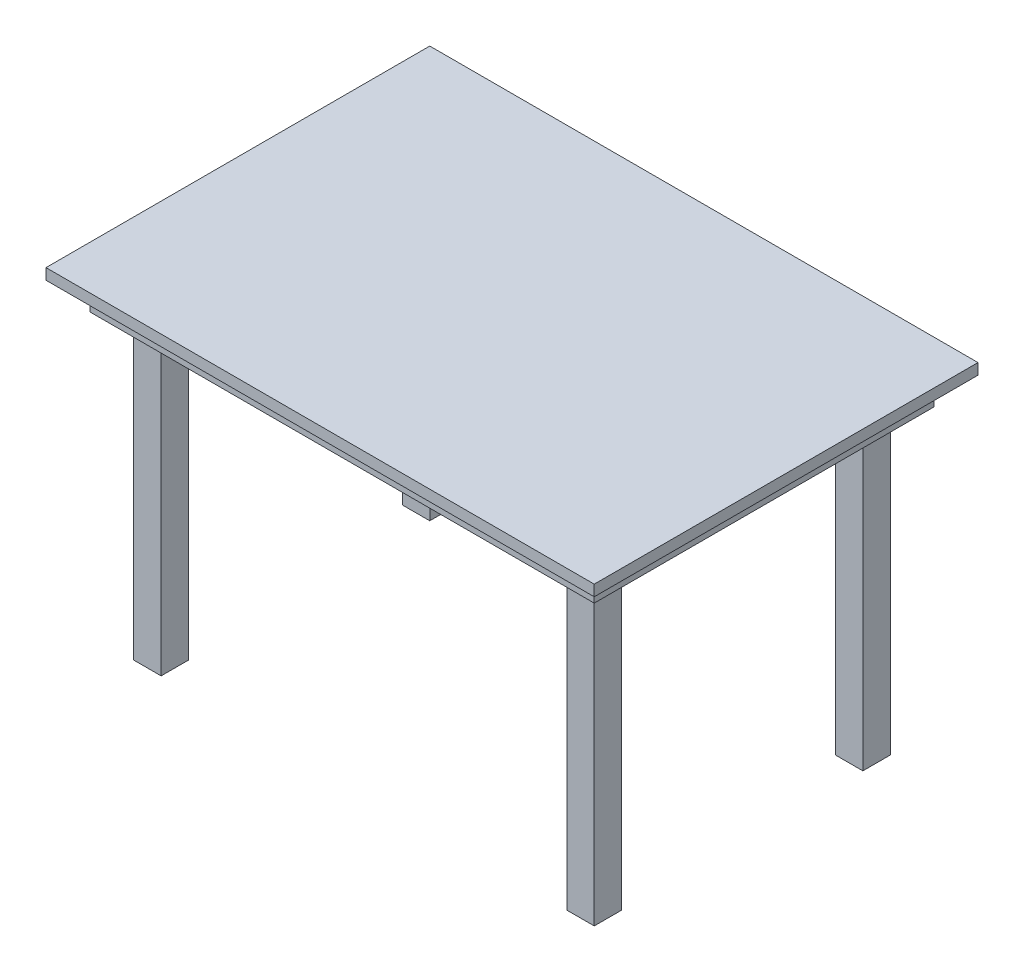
ISO-10303-21;
HEADER;
FILE_DESCRIPTION(('STEP AP214'),'2;1');
FILE_NAME('part.step','',(''),(''),'','','');
FILE_SCHEMA(('AUTOMOTIVE_DESIGN { 1 0 10303 214 1 1 1 1 }'));
ENDSEC;
DATA;
#1=APPLICATION_CONTEXT('core data for automotive mechanical design processes');
#2=APPLICATION_PROTOCOL_DEFINITION('international standard','automotive_design',2000,#1);
#3=PRODUCT_CONTEXT('',#1,'mechanical');
#4=PRODUCT('Part','Part','',(#3));
#5=PRODUCT_RELATED_PRODUCT_CATEGORY('part','',(#4));
#6=PRODUCT_DEFINITION_FORMATION('','',#4);
#7=PRODUCT_DEFINITION_CONTEXT('part definition',#1,'design');
#8=PRODUCT_DEFINITION('design','',#6,#7);
#9=PRODUCT_DEFINITION_SHAPE('','',#8);
#10=(LENGTH_UNIT() NAMED_UNIT(*) SI_UNIT(.MILLI.,.METRE.));
#11=(NAMED_UNIT(*) PLANE_ANGLE_UNIT() SI_UNIT($,.RADIAN.));
#12=(NAMED_UNIT(*) SI_UNIT($,.STERADIAN.) SOLID_ANGLE_UNIT());
#13=UNCERTAINTY_MEASURE_WITH_UNIT(LENGTH_MEASURE(1.E-05),#10,'distance_accuracy_value','');
#14=(GEOMETRIC_REPRESENTATION_CONTEXT(3) GLOBAL_UNCERTAINTY_ASSIGNED_CONTEXT((#13)) GLOBAL_UNIT_ASSIGNED_CONTEXT((#10,
#11,#12)) REPRESENTATION_CONTEXT('',''));
#15=CARTESIAN_POINT('',(0.,0.,0.));
#16=DIRECTION('',(0.,0.,1.));
#17=DIRECTION('',(1.,0.,0.));
#18=AXIS2_PLACEMENT_3D('',#15,#16,#17);
#19=CARTESIAN_POINT('',(0.,0.,0.));
#20=DIRECTION('',(0.,-1.,0.));
#21=DIRECTION('',(0.,0.,-1.));
#22=AXIS2_PLACEMENT_3D('',#19,#20,#21);
#23=PLANE('',#22);
#24=DIRECTION('',(-1.,0.,0.));
#25=VECTOR('',#24,1.);
#26=CARTESIAN_POINT('',(80.0000000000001,0.,-570.));
#27=LINE('',#26,#25);
#28=CARTESIAN_POINT('',(130.,0.,-570.));
#29=VERTEX_POINT('',#28);
#30=CARTESIAN_POINT('',(80.,0.,-570.));
#31=VERTEX_POINT('',#30);
#32=EDGE_CURVE('E51',#29,#31,#27,.T.);
#33=ORIENTED_EDGE('',*,*,#32,.F.);
#34=DIRECTION('',(0.,0.,1.));
#35=VECTOR('',#34,1.);
#36=CARTESIAN_POINT('',(130.,0.,-620.));
#37=LINE('',#36,#35);
#38=CARTESIAN_POINT('',(130.,0.,-620.));
#39=VERTEX_POINT('',#38);
#40=EDGE_CURVE('E55',#39,#29,#37,.T.);
#41=ORIENTED_EDGE('',*,*,#40,.F.);
#42=DIRECTION('',(1.,0.,0.));
#43=VECTOR('',#42,1.);
#44=CARTESIAN_POINT('',(80.,0.,-620.));
#45=LINE('',#44,#43);
#46=CARTESIAN_POINT('',(870.,0.,-620.));
#47=VERTEX_POINT('',#46);
#48=EDGE_CURVE('E355',#39,#47,#45,.T.);
#49=ORIENTED_EDGE('',*,*,#48,.T.);
#50=DIRECTION('',(0.,0.,-1.));
#51=VECTOR('',#50,1.);
#52=CARTESIAN_POINT('',(870.,0.,-620.));
#53=LINE('',#52,#51);
#54=CARTESIAN_POINT('',(870.,0.,-570.));
#55=VERTEX_POINT('',#54);
#56=EDGE_CURVE('E246',#55,#47,#53,.T.);
#57=ORIENTED_EDGE('',*,*,#56,.F.);
#58=DIRECTION('',(-1.,0.,0.));
#59=VECTOR('',#58,1.);
#60=CARTESIAN_POINT('',(920.,0.,-570.));
#61=LINE('',#60,#59);
#62=CARTESIAN_POINT('',(920.,0.,-570.));
#63=VERTEX_POINT('',#62);
#64=EDGE_CURVE('E244',#63,#55,#61,.T.);
#65=ORIENTED_EDGE('',*,*,#64,.F.);
#66=DIRECTION('',(0.,0.,1.));
#67=VECTOR('',#66,1.);
#68=CARTESIAN_POINT('',(920.,0.,-620.));
#69=LINE('',#68,#67);
#70=CARTESIAN_POINT('',(920.,0.,-130.));
#71=VERTEX_POINT('',#70);
#72=EDGE_CURVE('E334',#63,#71,#69,.T.);
#73=ORIENTED_EDGE('',*,*,#72,.T.);
#74=DIRECTION('',(1.,0.,0.));
#75=VECTOR('',#74,1.);
#76=CARTESIAN_POINT('',(920.,0.,-130.));
#77=LINE('',#76,#75);
#78=CARTESIAN_POINT('',(870.,0.,-130.));
#79=VERTEX_POINT('',#78);
#80=EDGE_CURVE('E281',#79,#71,#77,.T.);
#81=ORIENTED_EDGE('',*,*,#80,.F.);
#82=DIRECTION('',(0.,0.,-1.));
#83=VECTOR('',#82,1.);
#84=CARTESIAN_POINT('',(870.,0.,-79.9999999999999));
#85=LINE('',#84,#83);
#86=CARTESIAN_POINT('',(870.,0.,-79.9999999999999));
#87=VERTEX_POINT('',#86);
#88=EDGE_CURVE('E276',#87,#79,#85,.T.);
#89=ORIENTED_EDGE('',*,*,#88,.F.);
#90=DIRECTION('',(-1.,0.,0.));
#91=VECTOR('',#90,1.);
#92=CARTESIAN_POINT('',(920.,0.,-80.));
#93=LINE('',#92,#91);
#94=CARTESIAN_POINT('',(130.,0.,-80.));
#95=VERTEX_POINT('',#94);
#96=EDGE_CURVE('E351',#87,#95,#93,.T.);
#97=ORIENTED_EDGE('',*,*,#96,.T.);
#98=DIRECTION('',(0.,0.,1.));
#99=VECTOR('',#98,1.);
#100=CARTESIAN_POINT('',(130.,0.,-80.));
#101=LINE('',#100,#99);
#102=CARTESIAN_POINT('',(130.,0.,-130.));
#103=VERTEX_POINT('',#102);
#104=EDGE_CURVE('E308',#103,#95,#101,.T.);
#105=ORIENTED_EDGE('',*,*,#104,.F.);
#106=DIRECTION('',(1.,0.,0.));
#107=VECTOR('',#106,1.);
#108=CARTESIAN_POINT('',(80.,0.,-130.));
#109=LINE('',#108,#107);
#110=CARTESIAN_POINT('',(80.,0.,-130.));
#111=VERTEX_POINT('',#110);
#112=EDGE_CURVE('E303',#111,#103,#109,.T.);
#113=ORIENTED_EDGE('',*,*,#112,.F.);
#114=DIRECTION('',(0.,0.,-1.));
#115=VECTOR('',#114,1.);
#116=CARTESIAN_POINT('',(80.,0.,-80.));
#117=LINE('',#116,#115);
#118=EDGE_CURVE('E353',#111,#31,#117,.T.);
#119=ORIENTED_EDGE('',*,*,#118,.T.);
#120=EDGE_LOOP('',(#33,#41,#49,#57,#65,#73,#81,#89,#97,#105,#113,#119));
#121=FACE_BOUND('',#120,.T.);
#122=ADVANCED_FACE('F36',(#121),#23,.T.);
#123=CARTESIAN_POINT('',(80.,-50.,-620.));
#124=DIRECTION('',(0.,0.,1.));
#125=DIRECTION('',(1.,0.,0.));
#126=AXIS2_PLACEMENT_3D('',#123,#124,#125);
#127=PLANE('',#126);
#128=ORIENTED_EDGE('',*,*,#48,.F.);
#129=DIRECTION('',(0.,1.,0.));
#130=VECTOR('',#129,1.);
#131=CARTESIAN_POINT('',(130.,-600.,-620.));
#132=LINE('',#131,#130);
#133=CARTESIAN_POINT('',(130.,-50.,-620.));
#134=VERTEX_POINT('',#133);
#135=EDGE_CURVE('E248',#134,#39,#132,.T.);
#136=ORIENTED_EDGE('',*,*,#135,.F.);
#137=DIRECTION('',(1.,0.,0.));
#138=VECTOR('',#137,1.);
#139=CARTESIAN_POINT('',(80.,-50.,-620.));
#140=LINE('',#139,#138);
#141=CARTESIAN_POINT('',(870.,-50.,-620.));
#142=VERTEX_POINT('',#141);
#143=EDGE_CURVE('E349',#134,#142,#140,.T.);
#144=ORIENTED_EDGE('',*,*,#143,.T.);
#145=DIRECTION('',(0.,1.,0.));
#146=VECTOR('',#145,1.);
#147=CARTESIAN_POINT('',(870.,-50.,-620.));
#148=LINE('',#147,#146);
#149=EDGE_CURVE('E11',#142,#47,#148,.T.);
#150=ORIENTED_EDGE('',*,*,#149,.T.);
#151=EDGE_LOOP('',(#128,#136,#144,#150));
#152=FACE_BOUND('',#151,.T.);
#153=ADVANCED_FACE('F481',(#152),#127,.T.);
#154=CARTESIAN_POINT('',(80.,-50.,-80.));
#155=DIRECTION('',(1.,0.,0.));
#156=DIRECTION('',(0.,0.,-1.));
#157=AXIS2_PLACEMENT_3D('',#154,#155,#156);
#158=PLANE('',#157);
#159=DIRECTION('',(0.,0.,-1.));
#160=VECTOR('',#159,1.);
#161=CARTESIAN_POINT('',(80.,-50.,-80.));
#162=LINE('',#161,#160);
#163=CARTESIAN_POINT('',(80.,-50.,-130.));
#164=VERTEX_POINT('',#163);
#165=CARTESIAN_POINT('',(80.,-50.,-570.));
#166=VERTEX_POINT('',#165);
#167=EDGE_CURVE('E345',#164,#166,#162,.T.);
#168=ORIENTED_EDGE('',*,*,#167,.T.);
#169=DIRECTION('',(0.,1.,0.));
#170=VECTOR('',#169,1.);
#171=CARTESIAN_POINT('',(80.0000000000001,-600.,-570.));
#172=LINE('',#171,#170);
#173=EDGE_CURVE('E466',#166,#31,#172,.T.);
#174=ORIENTED_EDGE('',*,*,#173,.T.);
#175=ORIENTED_EDGE('',*,*,#118,.F.);
#176=DIRECTION('',(0.,1.,0.));
#177=VECTOR('',#176,1.);
#178=CARTESIAN_POINT('',(80.,-600.,-130.));
#179=LINE('',#178,#177);
#180=EDGE_CURVE('E327',#164,#111,#179,.T.);
#181=ORIENTED_EDGE('',*,*,#180,.F.);
#182=EDGE_LOOP('',(#168,#174,#175,#181));
#183=FACE_BOUND('',#182,.T.);
#184=ADVANCED_FACE('F463',(#183),#158,.T.);
#185=CARTESIAN_POINT('',(920.,-50.,-620.));
#186=DIRECTION('',(-1.,0.,0.));
#187=DIRECTION('',(0.,0.,1.));
#188=AXIS2_PLACEMENT_3D('',#185,#186,#187);
#189=PLANE('',#188);
#190=ORIENTED_EDGE('',*,*,#72,.F.);
#191=DIRECTION('',(0.,1.,0.));
#192=VECTOR('',#191,1.);
#193=CARTESIAN_POINT('',(920.,-600.,-570.));
#194=LINE('',#193,#192);
#195=CARTESIAN_POINT('',(920.,-50.,-570.));
#196=VERTEX_POINT('',#195);
#197=EDGE_CURVE('E272',#196,#63,#194,.T.);
#198=ORIENTED_EDGE('',*,*,#197,.F.);
#199=DIRECTION('',(0.,0.,1.));
#200=VECTOR('',#199,1.);
#201=CARTESIAN_POINT('',(920.,-50.,-620.));
#202=LINE('',#201,#200);
#203=CARTESIAN_POINT('',(920.,-50.,-130.));
#204=VERTEX_POINT('',#203);
#205=EDGE_CURVE('E338',#196,#204,#202,.T.);
#206=ORIENTED_EDGE('',*,*,#205,.T.);
#207=DIRECTION('',(0.,1.,0.));
#208=VECTOR('',#207,1.);
#209=CARTESIAN_POINT('',(920.,-50.,-130.));
#210=LINE('',#209,#208);
#211=EDGE_CURVE('E44',#204,#71,#210,.T.);
#212=ORIENTED_EDGE('',*,*,#211,.T.);
#213=EDGE_LOOP('',(#190,#198,#206,#212));
#214=FACE_BOUND('',#213,.T.);
#215=ADVANCED_FACE('F418',(#214),#189,.T.);
#216=CARTESIAN_POINT('',(920.,-50.,-80.));
#217=DIRECTION('',(0.,0.,-1.));
#218=DIRECTION('',(-1.,0.,0.));
#219=AXIS2_PLACEMENT_3D('',#216,#217,#218);
#220=PLANE('',#219);
#221=ORIENTED_EDGE('',*,*,#96,.F.);
#222=DIRECTION('',(0.,1.,0.));
#223=VECTOR('',#222,1.);
#224=CARTESIAN_POINT('',(870.,-600.,-79.9999999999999));
#225=LINE('',#224,#223);
#226=CARTESIAN_POINT('',(870.,-50.,-79.9999999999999));
#227=VERTEX_POINT('',#226);
#228=EDGE_CURVE('E296',#227,#87,#225,.T.);
#229=ORIENTED_EDGE('',*,*,#228,.F.);
#230=DIRECTION('',(-1.,0.,0.));
#231=VECTOR('',#230,1.);
#232=CARTESIAN_POINT('',(920.,-50.,-80.));
#233=LINE('',#232,#231);
#234=CARTESIAN_POINT('',(130.,-50.,-80.));
#235=VERTEX_POINT('',#234);
#236=EDGE_CURVE('E337',#227,#235,#233,.T.);
#237=ORIENTED_EDGE('',*,*,#236,.T.);
#238=DIRECTION('',(0.,1.,0.));
#239=VECTOR('',#238,1.);
#240=CARTESIAN_POINT('',(130.,-600.,-80.));
#241=LINE('',#240,#239);
#242=EDGE_CURVE('E321',#235,#95,#241,.T.);
#243=ORIENTED_EDGE('',*,*,#242,.T.);
#244=EDGE_LOOP('',(#221,#229,#237,#243));
#245=FACE_BOUND('',#244,.T.);
#246=ADVANCED_FACE('F447',(#245),#220,.T.);
#247=DIRECTION('',(0.,0.,1.));
#248=VECTOR('',#247,1.);
#249=CARTESIAN_POINT('',(0.,0.,0.));
#250=LINE('',#249,#248);
#251=CARTESIAN_POINT('',(0.,0.,-700.));
#252=VERTEX_POINT('',#251);
#253=CARTESIAN_POINT('',(0.,0.,0.));
#254=VERTEX_POINT('',#253);
#255=EDGE_CURVE('E385',#252,#254,#250,.T.);
#256=ORIENTED_EDGE('',*,*,#255,.F.);
#257=DIRECTION('',(-1.,0.,0.));
#258=VECTOR('',#257,1.);
#259=CARTESIAN_POINT('',(0.,0.,-700.));
#260=LINE('',#259,#258);
#261=CARTESIAN_POINT('',(1000.,0.,-700.));
#262=VERTEX_POINT('',#261);
#263=EDGE_CURVE('E390',#262,#252,#260,.T.);
#264=ORIENTED_EDGE('',*,*,#263,.F.);
#265=DIRECTION('',(0.,0.,-1.));
#266=VECTOR('',#265,1.);
#267=CARTESIAN_POINT('',(1000.,0.,0.));
#268=LINE('',#267,#266);
#269=CARTESIAN_POINT('',(1000.,0.,0.));
#270=VERTEX_POINT('',#269);
#271=EDGE_CURVE('E401',#270,#262,#268,.T.);
#272=ORIENTED_EDGE('',*,*,#271,.F.);
#273=DIRECTION('',(1.,0.,0.));
#274=VECTOR('',#273,1.);
#275=CARTESIAN_POINT('',(0.,0.,0.));
#276=LINE('',#275,#274);
#277=EDGE_CURVE('E399',#254,#270,#276,.T.);
#278=ORIENTED_EDGE('',*,*,#277,.F.);
#279=EDGE_LOOP('',(#256,#264,#272,#278));
#280=FACE_BOUND('',#279,.T.);
#281=DIRECTION('',(0.,0.,1.));
#282=VECTOR('',#281,1.);
#283=CARTESIAN_POINT('',(960.,0.,-660.));
#284=LINE('',#283,#282);
#285=CARTESIAN_POINT('',(960.,0.,-660.));
#286=VERTEX_POINT('',#285);
#287=CARTESIAN_POINT('',(960.,0.,-40.));
#288=VERTEX_POINT('',#287);
#289=EDGE_CURVE('E370',#286,#288,#284,.T.);
#290=ORIENTED_EDGE('',*,*,#289,.F.);
#291=DIRECTION('',(1.,0.,0.));
#292=VECTOR('',#291,1.);
#293=CARTESIAN_POINT('',(40.,0.,-660.));
#294=LINE('',#293,#292);
#295=CARTESIAN_POINT('',(40.,0.,-660.));
#296=VERTEX_POINT('',#295);
#297=EDGE_CURVE('E348',#296,#286,#294,.T.);
#298=ORIENTED_EDGE('',*,*,#297,.F.);
#299=DIRECTION('',(0.,0.,-1.));
#300=VECTOR('',#299,1.);
#301=CARTESIAN_POINT('',(40.,0.,-40.));
#302=LINE('',#301,#300);
#303=CARTESIAN_POINT('',(40.,0.,-40.));
#304=VERTEX_POINT('',#303);
#305=EDGE_CURVE('E361',#304,#296,#302,.T.);
#306=ORIENTED_EDGE('',*,*,#305,.F.);
#307=DIRECTION('',(-1.,0.,0.));
#308=VECTOR('',#307,1.);
#309=CARTESIAN_POINT('',(960.,0.,-40.));
#310=LINE('',#309,#308);
#311=EDGE_CURVE('E372',#288,#304,#310,.T.);
#312=ORIENTED_EDGE('',*,*,#311,.F.);
#313=EDGE_LOOP('',(#290,#298,#306,#312));
#314=FACE_BOUND('',#313,.T.);
#315=ADVANCED_FACE('F514',(#280,#314),#23,.T.);
#316=CARTESIAN_POINT('',(0.,20.,0.));
#317=DIRECTION('',(1.,0.,0.));
#318=DIRECTION('',(0.,0.,-1.));
#319=AXIS2_PLACEMENT_3D('',#316,#317,#318);
#320=PLANE('',#319);
#321=ORIENTED_EDGE('',*,*,#255,.T.);
#322=DIRECTION('',(0.,-1.,0.));
#323=VECTOR('',#322,1.);
#324=CARTESIAN_POINT('',(0.,20.,0.));
#325=LINE('',#324,#323);
#326=CARTESIAN_POINT('',(0.,20.,0.));
#327=VERTEX_POINT('',#326);
#328=EDGE_CURVE('E412',#327,#254,#325,.T.);
#329=ORIENTED_EDGE('',*,*,#328,.F.);
#330=DIRECTION('',(0.,0.,1.));
#331=VECTOR('',#330,1.);
#332=CARTESIAN_POINT('',(0.,20.,0.));
#333=LINE('',#332,#331);
#334=CARTESIAN_POINT('',(0.,20.,-700.));
#335=VERTEX_POINT('',#334);
#336=EDGE_CURVE('E386',#335,#327,#333,.T.);
#337=ORIENTED_EDGE('',*,*,#336,.F.);
#338=DIRECTION('',(0.,-1.,0.));
#339=VECTOR('',#338,1.);
#340=CARTESIAN_POINT('',(0.,20.,-700.));
#341=LINE('',#340,#339);
#342=EDGE_CURVE('E396',#335,#252,#341,.T.);
#343=ORIENTED_EDGE('',*,*,#342,.T.);
#344=EDGE_LOOP('',(#321,#329,#337,#343));
#345=FACE_BOUND('',#344,.T.);
#346=ADVANCED_FACE('F38',(#345),#320,.F.);
#347=CARTESIAN_POINT('',(0.,20.,0.));
#348=DIRECTION('',(0.,0.,-1.));
#349=DIRECTION('',(-1.,0.,0.));
#350=AXIS2_PLACEMENT_3D('',#347,#348,#349);
#351=PLANE('',#350);
#352=ORIENTED_EDGE('',*,*,#277,.T.);
#353=DIRECTION('',(0.,-1.,0.));
#354=VECTOR('',#353,1.);
#355=CARTESIAN_POINT('',(1000.,20.,0.));
#356=LINE('',#355,#354);
#357=CARTESIAN_POINT('',(1000.,20.,0.));
#358=VERTEX_POINT('',#357);
#359=EDGE_CURVE('E409',#358,#270,#356,.T.);
#360=ORIENTED_EDGE('',*,*,#359,.F.);
#361=DIRECTION('',(1.,0.,0.));
#362=VECTOR('',#361,1.);
#363=CARTESIAN_POINT('',(0.,20.,0.));
#364=LINE('',#363,#362);
#365=EDGE_CURVE('E389',#327,#358,#364,.T.);
#366=ORIENTED_EDGE('',*,*,#365,.F.);
#367=ORIENTED_EDGE('',*,*,#328,.T.);
#368=EDGE_LOOP('',(#352,#360,#366,#367));
#369=FACE_BOUND('',#368,.T.);
#370=ADVANCED_FACE('F527',(#369),#351,.F.);
#371=CARTESIAN_POINT('',(1000.,20.,0.));
#372=DIRECTION('',(-1.,0.,0.));
#373=DIRECTION('',(0.,0.,1.));
#374=AXIS2_PLACEMENT_3D('',#371,#372,#373);
#375=PLANE('',#374);
#376=ORIENTED_EDGE('',*,*,#271,.T.);
#377=DIRECTION('',(0.,-1.,0.));
#378=VECTOR('',#377,1.);
#379=CARTESIAN_POINT('',(1000.,20.,-700.));
#380=LINE('',#379,#378);
#381=CARTESIAN_POINT('',(1000.,20.,-700.));
#382=VERTEX_POINT('',#381);
#383=EDGE_CURVE('E406',#382,#262,#380,.T.);
#384=ORIENTED_EDGE('',*,*,#383,.F.);
#385=DIRECTION('',(0.,0.,-1.));
#386=VECTOR('',#385,1.);
#387=CARTESIAN_POINT('',(1000.,20.,0.));
#388=LINE('',#387,#386);
#389=EDGE_CURVE('E392',#358,#382,#388,.T.);
#390=ORIENTED_EDGE('',*,*,#389,.F.);
#391=ORIENTED_EDGE('',*,*,#359,.T.);
#392=EDGE_LOOP('',(#376,#384,#390,#391));
#393=FACE_BOUND('',#392,.T.);
#394=ADVANCED_FACE('F577',(#393),#375,.F.);
#395=CARTESIAN_POINT('',(0.,20.,-700.));
#396=DIRECTION('',(0.,0.,1.));
#397=DIRECTION('',(1.,0.,0.));
#398=AXIS2_PLACEMENT_3D('',#395,#396,#397);
#399=PLANE('',#398);
#400=ORIENTED_EDGE('',*,*,#263,.T.);
#401=ORIENTED_EDGE('',*,*,#342,.F.);
#402=DIRECTION('',(-1.,0.,0.));
#403=VECTOR('',#402,1.);
#404=CARTESIAN_POINT('',(0.,20.,-700.));
#405=LINE('',#404,#403);
#406=EDGE_CURVE('E394',#382,#335,#405,.T.);
#407=ORIENTED_EDGE('',*,*,#406,.F.);
#408=ORIENTED_EDGE('',*,*,#383,.T.);
#409=EDGE_LOOP('',(#400,#401,#407,#408));
#410=FACE_BOUND('',#409,.T.);
#411=ADVANCED_FACE('F571',(#410),#399,.F.);
#412=CARTESIAN_POINT('',(0.,20.,0.));
#413=DIRECTION('',(0.,-1.,0.));
#414=DIRECTION('',(0.,0.,-1.));
#415=AXIS2_PLACEMENT_3D('',#412,#413,#414);
#416=PLANE('',#415);
#417=ORIENTED_EDGE('',*,*,#336,.T.);
#418=ORIENTED_EDGE('',*,*,#365,.T.);
#419=ORIENTED_EDGE('',*,*,#389,.T.);
#420=ORIENTED_EDGE('',*,*,#406,.T.);
#421=EDGE_LOOP('',(#417,#418,#419,#420));
#422=FACE_BOUND('',#421,.T.);
#423=ADVANCED_FACE('F569',(#422),#416,.F.);
#424=CARTESIAN_POINT('',(0.,-50.,0.));
#425=DIRECTION('',(0.,-1.,0.));
#426=DIRECTION('',(0.,0.,-1.));
#427=AXIS2_PLACEMENT_3D('',#424,#425,#426);
#428=PLANE('',#427);
#429=DIRECTION('',(1.,0.,0.));
#430=VECTOR('',#429,1.);
#431=CARTESIAN_POINT('',(40.,-50.,-660.));
#432=LINE('',#431,#430);
#433=CARTESIAN_POINT('',(40.,-50.,-660.));
#434=VERTEX_POINT('',#433);
#435=CARTESIAN_POINT('',(960.,-50.,-660.));
#436=VERTEX_POINT('',#435);
#437=EDGE_CURVE('E357',#434,#436,#432,.T.);
#438=ORIENTED_EDGE('',*,*,#437,.T.);
#439=DIRECTION('',(0.,0.,1.));
#440=VECTOR('',#439,1.);
#441=CARTESIAN_POINT('',(960.,-50.,-660.));
#442=LINE('',#441,#440);
#443=CARTESIAN_POINT('',(960.,-50.,-40.));
#444=VERTEX_POINT('',#443);
#445=EDGE_CURVE('E360',#436,#444,#442,.T.);
#446=ORIENTED_EDGE('',*,*,#445,.T.);
#447=DIRECTION('',(-1.,0.,0.));
#448=VECTOR('',#447,1.);
#449=CARTESIAN_POINT('',(960.,-50.,-40.));
#450=LINE('',#449,#448);
#451=CARTESIAN_POINT('',(40.,-50.,-40.));
#452=VERTEX_POINT('',#451);
#453=EDGE_CURVE('E363',#444,#452,#450,.T.);
#454=ORIENTED_EDGE('',*,*,#453,.T.);
#455=DIRECTION('',(0.,0.,-1.));
#456=VECTOR('',#455,1.);
#457=CARTESIAN_POINT('',(40.,-50.,-40.));
#458=LINE('',#457,#456);
#459=EDGE_CURVE('E365',#452,#434,#458,.T.);
#460=ORIENTED_EDGE('',*,*,#459,.T.);
#461=EDGE_LOOP('',(#438,#446,#454,#460));
#462=FACE_BOUND('',#461,.T.);
#463=CARTESIAN_POINT('',(920.,-50.,-80.));
#464=VERTEX_POINT('',#463);
#465=EDGE_CURVE('E340',#464,#227,#233,.T.);
#466=ORIENTED_EDGE('',*,*,#465,.F.);
#467=EDGE_CURVE('E339',#204,#464,#202,.T.);
#468=ORIENTED_EDGE('',*,*,#467,.F.);
#469=ORIENTED_EDGE('',*,*,#205,.F.);
#470=CARTESIAN_POINT('',(920.,-50.,-620.));
#471=VERTEX_POINT('',#470);
#472=EDGE_CURVE('E335',#471,#196,#202,.T.);
#473=ORIENTED_EDGE('',*,*,#472,.F.);
#474=EDGE_CURVE('E344',#142,#471,#140,.T.);
#475=ORIENTED_EDGE('',*,*,#474,.F.);
#476=ORIENTED_EDGE('',*,*,#143,.F.);
#477=CARTESIAN_POINT('',(80.,-50.,-620.));
#478=VERTEX_POINT('',#477);
#479=EDGE_CURVE('E346',#478,#134,#140,.T.);
#480=ORIENTED_EDGE('',*,*,#479,.F.);
#481=EDGE_CURVE('E243',#166,#478,#162,.T.);
#482=ORIENTED_EDGE('',*,*,#481,.F.);
#483=ORIENTED_EDGE('',*,*,#167,.F.);
#484=CARTESIAN_POINT('',(80.,-50.,-80.));
#485=VERTEX_POINT('',#484);
#486=EDGE_CURVE('E342',#485,#164,#162,.T.);
#487=ORIENTED_EDGE('',*,*,#486,.F.);
#488=DIRECTION('',(1.,0.,0.));
#489=VECTOR('',#488,1.);
#490=CARTESIAN_POINT('',(0.,-50.,-80.));
#491=LINE('',#490,#489);
#492=EDGE_CURVE('E331',#485,#235,#491,.T.);
#493=ORIENTED_EDGE('',*,*,#492,.T.);
#494=ORIENTED_EDGE('',*,*,#236,.F.);
#495=EDGE_LOOP('',(#466,#468,#469,#473,#475,#476,#480,#482,#483,#487,#493,#494));
#496=FACE_BOUND('',#495,.T.);
#497=ADVANCED_FACE('F433',(#462,#496),#428,.T.);
#498=CARTESIAN_POINT('',(40.,-50.,-660.));
#499=DIRECTION('',(0.,0.,1.));
#500=DIRECTION('',(1.,0.,0.));
#501=AXIS2_PLACEMENT_3D('',#498,#499,#500);
#502=PLANE('',#501);
#503=ORIENTED_EDGE('',*,*,#297,.T.);
#504=DIRECTION('',(0.,1.,0.));
#505=VECTOR('',#504,1.);
#506=CARTESIAN_POINT('',(960.,-50.,-660.));
#507=LINE('',#506,#505);
#508=EDGE_CURVE('E383',#436,#286,#507,.T.);
#509=ORIENTED_EDGE('',*,*,#508,.F.);
#510=ORIENTED_EDGE('',*,*,#437,.F.);
#511=DIRECTION('',(0.,1.,0.));
#512=VECTOR('',#511,1.);
#513=CARTESIAN_POINT('',(40.,-50.,-660.));
#514=LINE('',#513,#512);
#515=EDGE_CURVE('E367',#434,#296,#514,.T.);
#516=ORIENTED_EDGE('',*,*,#515,.T.);
#517=EDGE_LOOP('',(#503,#509,#510,#516));
#518=FACE_BOUND('',#517,.T.);
#519=ADVANCED_FACE('F550',(#518),#502,.F.);
#520=CARTESIAN_POINT('',(960.,-50.,-660.));
#521=DIRECTION('',(-1.,0.,0.));
#522=DIRECTION('',(0.,0.,1.));
#523=AXIS2_PLACEMENT_3D('',#520,#521,#522);
#524=PLANE('',#523);
#525=ORIENTED_EDGE('',*,*,#289,.T.);
#526=DIRECTION('',(0.,1.,0.));
#527=VECTOR('',#526,1.);
#528=CARTESIAN_POINT('',(960.,-50.,-40.));
#529=LINE('',#528,#527);
#530=EDGE_CURVE('E380',#444,#288,#529,.T.);
#531=ORIENTED_EDGE('',*,*,#530,.F.);
#532=ORIENTED_EDGE('',*,*,#445,.F.);
#533=ORIENTED_EDGE('',*,*,#508,.T.);
#534=EDGE_LOOP('',(#525,#531,#532,#533));
#535=FACE_BOUND('',#534,.T.);
#536=ADVANCED_FACE('F539',(#535),#524,.F.);
#537=CARTESIAN_POINT('',(960.,-50.,-40.));
#538=DIRECTION('',(0.,0.,-1.));
#539=DIRECTION('',(-1.,0.,0.));
#540=AXIS2_PLACEMENT_3D('',#537,#538,#539);
#541=PLANE('',#540);
#542=ORIENTED_EDGE('',*,*,#311,.T.);
#543=DIRECTION('',(0.,1.,0.));
#544=VECTOR('',#543,1.);
#545=CARTESIAN_POINT('',(40.,-50.,-40.));
#546=LINE('',#545,#544);
#547=EDGE_CURVE('E378',#452,#304,#546,.T.);
#548=ORIENTED_EDGE('',*,*,#547,.F.);
#549=ORIENTED_EDGE('',*,*,#453,.F.);
#550=ORIENTED_EDGE('',*,*,#530,.T.);
#551=EDGE_LOOP('',(#542,#548,#549,#550));
#552=FACE_BOUND('',#551,.T.);
#553=ADVANCED_FACE('F543',(#552),#541,.F.);
#554=CARTESIAN_POINT('',(40.,-50.,-40.));
#555=DIRECTION('',(1.,0.,0.));
#556=DIRECTION('',(0.,0.,-1.));
#557=AXIS2_PLACEMENT_3D('',#554,#555,#556);
#558=PLANE('',#557);
#559=ORIENTED_EDGE('',*,*,#305,.T.);
#560=ORIENTED_EDGE('',*,*,#515,.F.);
#561=ORIENTED_EDGE('',*,*,#459,.F.);
#562=ORIENTED_EDGE('',*,*,#547,.T.);
#563=EDGE_LOOP('',(#559,#560,#561,#562));
#564=FACE_BOUND('',#563,.T.);
#565=ADVANCED_FACE('F552',(#564),#558,.F.);
#566=CARTESIAN_POINT('',(80.,-600.,-80.));
#567=DIRECTION('',(1.,0.,0.));
#568=DIRECTION('',(0.,0.,-1.));
#569=AXIS2_PLACEMENT_3D('',#566,#567,#568);
#570=PLANE('',#569);
#571=ORIENTED_EDGE('',*,*,#486,.T.);
#572=CARTESIAN_POINT('',(80.,-600.,-130.));
#573=VERTEX_POINT('',#572);
#574=EDGE_CURVE('E328',#573,#164,#179,.T.);
#575=ORIENTED_EDGE('',*,*,#574,.F.);
#576=DIRECTION('',(0.,0.,-1.));
#577=VECTOR('',#576,1.);
#578=CARTESIAN_POINT('',(80.,-600.,-80.));
#579=LINE('',#578,#577);
#580=CARTESIAN_POINT('',(80.,-600.,-80.));
#581=VERTEX_POINT('',#580);
#582=EDGE_CURVE('E304',#581,#573,#579,.T.);
#583=ORIENTED_EDGE('',*,*,#582,.F.);
#584=DIRECTION('',(0.,1.,0.));
#585=VECTOR('',#584,1.);
#586=CARTESIAN_POINT('',(80.,-600.,-80.));
#587=LINE('',#586,#585);
#588=EDGE_CURVE('E314',#581,#485,#587,.T.);
#589=ORIENTED_EDGE('',*,*,#588,.T.);
#590=EDGE_LOOP('',(#571,#575,#583,#589));
#591=FACE_BOUND('',#590,.T.);
#592=ADVANCED_FACE('F554',(#591),#570,.F.);
#593=CARTESIAN_POINT('',(80.,-600.,-130.));
#594=DIRECTION('',(0.,0.,1.));
#595=DIRECTION('',(1.,0.,0.));
#596=AXIS2_PLACEMENT_3D('',#593,#594,#595);
#597=PLANE('',#596);
#598=ORIENTED_EDGE('',*,*,#112,.T.);
#599=DIRECTION('',(0.,1.,0.));
#600=VECTOR('',#599,1.);
#601=CARTESIAN_POINT('',(130.,-600.,-130.));
#602=LINE('',#601,#600);
#603=CARTESIAN_POINT('',(130.,-600.,-130.));
#604=VERTEX_POINT('',#603);
#605=EDGE_CURVE('E325',#604,#103,#602,.T.);
#606=ORIENTED_EDGE('',*,*,#605,.F.);
#607=DIRECTION('',(1.,0.,0.));
#608=VECTOR('',#607,1.);
#609=CARTESIAN_POINT('',(80.,-600.,-130.));
#610=LINE('',#609,#608);
#611=EDGE_CURVE('E307',#573,#604,#610,.T.);
#612=ORIENTED_EDGE('',*,*,#611,.F.);
#613=ORIENTED_EDGE('',*,*,#574,.T.);
#614=ORIENTED_EDGE('',*,*,#180,.T.);
#615=EDGE_LOOP('',(#598,#606,#612,#613,#614));
#616=FACE_BOUND('',#615,.T.);
#617=ADVANCED_FACE('F458',(#616),#597,.F.);
#618=CARTESIAN_POINT('',(130.,-600.,-80.));
#619=DIRECTION('',(-1.,0.,0.));
#620=DIRECTION('',(0.,0.,1.));
#621=AXIS2_PLACEMENT_3D('',#618,#619,#620);
#622=PLANE('',#621);
#623=ORIENTED_EDGE('',*,*,#104,.T.);
#624=ORIENTED_EDGE('',*,*,#242,.F.);
#625=CARTESIAN_POINT('',(130.,-600.,-80.));
#626=VERTEX_POINT('',#625);
#627=EDGE_CURVE('E322',#626,#235,#241,.T.);
#628=ORIENTED_EDGE('',*,*,#627,.F.);
#629=DIRECTION('',(0.,0.,1.));
#630=VECTOR('',#629,1.);
#631=CARTESIAN_POINT('',(130.,-600.,-80.));
#632=LINE('',#631,#630);
#633=EDGE_CURVE('E310',#604,#626,#632,.T.);
#634=ORIENTED_EDGE('',*,*,#633,.F.);
#635=ORIENTED_EDGE('',*,*,#605,.T.);
#636=EDGE_LOOP('',(#623,#624,#628,#634,#635));
#637=FACE_BOUND('',#636,.T.);
#638=ADVANCED_FACE('F453',(#637),#622,.F.);
#639=CARTESIAN_POINT('',(80.,-600.,-80.));
#640=DIRECTION('',(0.,0.,-1.));
#641=DIRECTION('',(-1.,0.,0.));
#642=AXIS2_PLACEMENT_3D('',#639,#640,#641);
#643=PLANE('',#642);
#644=ORIENTED_EDGE('',*,*,#492,.F.);
#645=ORIENTED_EDGE('',*,*,#588,.F.);
#646=DIRECTION('',(-1.,0.,0.));
#647=VECTOR('',#646,1.);
#648=CARTESIAN_POINT('',(80.,-600.,-80.));
#649=LINE('',#648,#647);
#650=EDGE_CURVE('E312',#626,#581,#649,.T.);
#651=ORIENTED_EDGE('',*,*,#650,.F.);
#652=ORIENTED_EDGE('',*,*,#627,.T.);
#653=EDGE_LOOP('',(#644,#645,#651,#652));
#654=FACE_BOUND('',#653,.T.);
#655=ADVANCED_FACE('F692',(#654),#643,.F.);
#656=CARTESIAN_POINT('',(0.,-600.,0.));
#657=DIRECTION('',(0.,-1.,0.));
#658=DIRECTION('',(0.,0.,-1.));
#659=AXIS2_PLACEMENT_3D('',#656,#657,#658);
#660=PLANE('',#659);
#661=ORIENTED_EDGE('',*,*,#582,.T.);
#662=ORIENTED_EDGE('',*,*,#611,.T.);
#663=ORIENTED_EDGE('',*,*,#633,.T.);
#664=ORIENTED_EDGE('',*,*,#650,.T.);
#665=EDGE_LOOP('',(#661,#662,#663,#664));
#666=FACE_BOUND('',#665,.T.);
#667=ADVANCED_FACE('F700',(#666),#660,.T.);
#668=CARTESIAN_POINT('',(920.,-600.,-80.));
#669=DIRECTION('',(-1.,0.,0.));
#670=DIRECTION('',(0.,0.,1.));
#671=AXIS2_PLACEMENT_3D('',#668,#669,#670);
#672=PLANE('',#671);
#673=ORIENTED_EDGE('',*,*,#467,.T.);
#674=DIRECTION('',(0.,1.,0.));
#675=VECTOR('',#674,1.);
#676=CARTESIAN_POINT('',(920.,-600.,-80.));
#677=LINE('',#676,#675);
#678=CARTESIAN_POINT('',(920.,-600.,-80.));
#679=VERTEX_POINT('',#678);
#680=EDGE_CURVE('E300',#679,#464,#677,.T.);
#681=ORIENTED_EDGE('',*,*,#680,.F.);
#682=DIRECTION('',(0.,0.,1.));
#683=VECTOR('',#682,1.);
#684=CARTESIAN_POINT('',(920.,-600.,-80.));
#685=LINE('',#684,#683);
#686=CARTESIAN_POINT('',(920.,-600.,-130.));
#687=VERTEX_POINT('',#686);
#688=EDGE_CURVE('E277',#687,#679,#685,.T.);
#689=ORIENTED_EDGE('',*,*,#688,.F.);
#690=DIRECTION('',(0.,1.,0.));
#691=VECTOR('',#690,1.);
#692=CARTESIAN_POINT('',(920.,-600.,-130.));
#693=LINE('',#692,#691);
#694=EDGE_CURVE('E287',#687,#204,#693,.T.);
#695=ORIENTED_EDGE('',*,*,#694,.T.);
#696=EDGE_LOOP('',(#673,#681,#689,#695));
#697=FACE_BOUND('',#696,.T.);
#698=ADVANCED_FACE('F429',(#697),#672,.F.);
#699=CARTESIAN_POINT('',(920.,-600.,-80.));
#700=DIRECTION('',(0.,0.,-1.));
#701=DIRECTION('',(-1.,0.,0.));
#702=AXIS2_PLACEMENT_3D('',#699,#700,#701);
#703=PLANE('',#702);
#704=ORIENTED_EDGE('',*,*,#465,.T.);
#705=CARTESIAN_POINT('',(870.,-600.,-79.9999999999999));
#706=VERTEX_POINT('',#705);
#707=EDGE_CURVE('E297',#706,#227,#225,.T.);
#708=ORIENTED_EDGE('',*,*,#707,.F.);
#709=DIRECTION('',(-1.,0.,0.));
#710=VECTOR('',#709,1.);
#711=CARTESIAN_POINT('',(920.,-600.,-80.));
#712=LINE('',#711,#710);
#713=EDGE_CURVE('E280',#679,#706,#712,.T.);
#714=ORIENTED_EDGE('',*,*,#713,.F.);
#715=ORIENTED_EDGE('',*,*,#680,.T.);
#716=EDGE_LOOP('',(#704,#708,#714,#715));
#717=FACE_BOUND('',#716,.T.);
#718=ADVANCED_FACE('F438',(#717),#703,.F.);
#719=CARTESIAN_POINT('',(870.,-600.,-79.9999999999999));
#720=DIRECTION('',(1.,0.,0.));
#721=DIRECTION('',(0.,0.,-1.));
#722=AXIS2_PLACEMENT_3D('',#719,#720,#721);
#723=PLANE('',#722);
#724=ORIENTED_EDGE('',*,*,#88,.T.);
#725=DIRECTION('',(0.,1.,0.));
#726=VECTOR('',#725,1.);
#727=CARTESIAN_POINT('',(870.,-600.,-130.));
#728=LINE('',#727,#726);
#729=CARTESIAN_POINT('',(870.,-600.,-130.));
#730=VERTEX_POINT('',#729);
#731=EDGE_CURVE('E293',#730,#79,#728,.T.);
#732=ORIENTED_EDGE('',*,*,#731,.F.);
#733=DIRECTION('',(0.,0.,-1.));
#734=VECTOR('',#733,1.);
#735=CARTESIAN_POINT('',(870.,-600.,-79.9999999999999));
#736=LINE('',#735,#734);
#737=EDGE_CURVE('E283',#706,#730,#736,.T.);
#738=ORIENTED_EDGE('',*,*,#737,.F.);
#739=ORIENTED_EDGE('',*,*,#707,.T.);
#740=ORIENTED_EDGE('',*,*,#228,.T.);
#741=EDGE_LOOP('',(#724,#732,#738,#739,#740));
#742=FACE_BOUND('',#741,.T.);
#743=ADVANCED_FACE('F442',(#742),#723,.F.);
#744=CARTESIAN_POINT('',(920.,-600.,-130.));
#745=DIRECTION('',(0.,0.,1.));
#746=DIRECTION('',(1.,0.,0.));
#747=AXIS2_PLACEMENT_3D('',#744,#745,#746);
#748=PLANE('',#747);
#749=ORIENTED_EDGE('',*,*,#80,.T.);
#750=ORIENTED_EDGE('',*,*,#211,.F.);
#751=ORIENTED_EDGE('',*,*,#694,.F.);
#752=DIRECTION('',(1.,0.,0.));
#753=VECTOR('',#752,1.);
#754=CARTESIAN_POINT('',(920.,-600.,-130.));
#755=LINE('',#754,#753);
#756=EDGE_CURVE('E285',#730,#687,#755,.T.);
#757=ORIENTED_EDGE('',*,*,#756,.F.);
#758=ORIENTED_EDGE('',*,*,#731,.T.);
#759=EDGE_LOOP('',(#749,#750,#751,#757,#758));
#760=FACE_BOUND('',#759,.T.);
#761=ADVANCED_FACE('F423',(#760),#748,.F.);
#762=CARTESIAN_POINT('',(0.,-600.,0.));
#763=DIRECTION('',(0.,1.,0.));
#764=DIRECTION('',(0.,0.,1.));
#765=AXIS2_PLACEMENT_3D('',#762,#763,#764);
#766=PLANE('',#765);
#767=ORIENTED_EDGE('',*,*,#688,.T.);
#768=ORIENTED_EDGE('',*,*,#713,.T.);
#769=ORIENTED_EDGE('',*,*,#737,.T.);
#770=ORIENTED_EDGE('',*,*,#756,.T.);
#771=EDGE_LOOP('',(#767,#768,#769,#770));
#772=FACE_BOUND('',#771,.T.);
#773=ADVANCED_FACE('F510',(#772),#766,.F.);
#774=CARTESIAN_POINT('',(920.,-600.,-620.));
#775=DIRECTION('',(-1.,0.,0.));
#776=DIRECTION('',(0.,0.,1.));
#777=AXIS2_PLACEMENT_3D('',#774,#775,#776);
#778=PLANE('',#777);
#779=ORIENTED_EDGE('',*,*,#472,.T.);
#780=CARTESIAN_POINT('',(920.,-600.,-570.));
#781=VERTEX_POINT('',#780);
#782=EDGE_CURVE('E273',#781,#196,#194,.T.);
#783=ORIENTED_EDGE('',*,*,#782,.F.);
#784=DIRECTION('',(0.,0.,1.));
#785=VECTOR('',#784,1.);
#786=CARTESIAN_POINT('',(920.,-600.,-620.));
#787=LINE('',#786,#785);
#788=CARTESIAN_POINT('',(920.,-600.,-620.));
#789=VERTEX_POINT('',#788);
#790=EDGE_CURVE('E252',#789,#781,#787,.T.);
#791=ORIENTED_EDGE('',*,*,#790,.F.);
#792=DIRECTION('',(0.,1.,0.));
#793=VECTOR('',#792,1.);
#794=CARTESIAN_POINT('',(920.,-600.,-620.));
#795=LINE('',#794,#793);
#796=EDGE_CURVE('E260',#789,#471,#795,.T.);
#797=ORIENTED_EDGE('',*,*,#796,.T.);
#798=EDGE_LOOP('',(#779,#783,#791,#797));
#799=FACE_BOUND('',#798,.T.);
#800=ADVANCED_FACE('F491',(#799),#778,.F.);
#801=CARTESIAN_POINT('',(920.,-600.,-570.));
#802=DIRECTION('',(0.,0.,-1.));
#803=DIRECTION('',(-1.,0.,0.));
#804=AXIS2_PLACEMENT_3D('',#801,#802,#803);
#805=PLANE('',#804);
#806=ORIENTED_EDGE('',*,*,#64,.T.);
#807=DIRECTION('',(0.,1.,0.));
#808=VECTOR('',#807,1.);
#809=CARTESIAN_POINT('',(870.,-600.,-570.));
#810=LINE('',#809,#808);
#811=CARTESIAN_POINT('',(870.,-600.,-570.));
#812=VERTEX_POINT('',#811);
#813=EDGE_CURVE('E269',#812,#55,#810,.T.);
#814=ORIENTED_EDGE('',*,*,#813,.F.);
#815=DIRECTION('',(-1.,0.,0.));
#816=VECTOR('',#815,1.);
#817=CARTESIAN_POINT('',(920.,-600.,-570.));
#818=LINE('',#817,#816);
#819=EDGE_CURVE('E255',#781,#812,#818,.T.);
#820=ORIENTED_EDGE('',*,*,#819,.F.);
#821=ORIENTED_EDGE('',*,*,#782,.T.);
#822=ORIENTED_EDGE('',*,*,#197,.T.);
#823=EDGE_LOOP('',(#806,#814,#820,#821,#822));
#824=FACE_BOUND('',#823,.T.);
#825=ADVANCED_FACE('F502',(#824),#805,.F.);
#826=CARTESIAN_POINT('',(870.,-600.,-620.));
#827=DIRECTION('',(1.,0.,0.));
#828=DIRECTION('',(0.,0.,-1.));
#829=AXIS2_PLACEMENT_3D('',#826,#827,#828);
#830=PLANE('',#829);
#831=ORIENTED_EDGE('',*,*,#56,.T.);
#832=ORIENTED_EDGE('',*,*,#149,.F.);
#833=DIRECTION('',(0.,1.,0.));
#834=VECTOR('',#833,1.);
#835=CARTESIAN_POINT('',(870.,-600.,-620.));
#836=LINE('',#835,#834);
#837=CARTESIAN_POINT('',(870.,-600.,-620.));
#838=VERTEX_POINT('',#837);
#839=EDGE_CURVE('E266',#838,#142,#836,.T.);
#840=ORIENTED_EDGE('',*,*,#839,.F.);
#841=DIRECTION('',(0.,0.,-1.));
#842=VECTOR('',#841,1.);
#843=CARTESIAN_POINT('',(870.,-600.,-620.));
#844=LINE('',#843,#842);
#845=EDGE_CURVE('E257',#812,#838,#844,.T.);
#846=ORIENTED_EDGE('',*,*,#845,.F.);
#847=ORIENTED_EDGE('',*,*,#813,.T.);
#848=EDGE_LOOP('',(#831,#832,#840,#846,#847));
#849=FACE_BOUND('',#848,.T.);
#850=ADVANCED_FACE('F498',(#849),#830,.F.);
#851=CARTESIAN_POINT('',(920.,-600.,-620.));
#852=DIRECTION('',(0.,0.,1.));
#853=DIRECTION('',(1.,0.,0.));
#854=AXIS2_PLACEMENT_3D('',#851,#852,#853);
#855=PLANE('',#854);
#856=ORIENTED_EDGE('',*,*,#474,.T.);
#857=ORIENTED_EDGE('',*,*,#796,.F.);
#858=DIRECTION('',(1.,0.,0.));
#859=VECTOR('',#858,1.);
#860=CARTESIAN_POINT('',(920.,-600.,-620.));
#861=LINE('',#860,#859);
#862=EDGE_CURVE('E259',#838,#789,#861,.T.);
#863=ORIENTED_EDGE('',*,*,#862,.F.);
#864=ORIENTED_EDGE('',*,*,#839,.T.);
#865=EDGE_LOOP('',(#856,#857,#863,#864));
#866=FACE_BOUND('',#865,.T.);
#867=ADVANCED_FACE('F486',(#866),#855,.F.);
#868=CARTESIAN_POINT('',(0.,-600.,0.));
#869=DIRECTION('',(0.,-1.,0.));
#870=DIRECTION('',(0.,0.,-1.));
#871=AXIS2_PLACEMENT_3D('',#868,#869,#870);
#872=PLANE('',#871);
#873=ORIENTED_EDGE('',*,*,#790,.T.);
#874=ORIENTED_EDGE('',*,*,#819,.T.);
#875=ORIENTED_EDGE('',*,*,#845,.T.);
#876=ORIENTED_EDGE('',*,*,#862,.T.);
#877=EDGE_LOOP('',(#873,#874,#875,#876));
#878=FACE_BOUND('',#877,.T.);
#879=ADVANCED_FACE('F494',(#878),#872,.T.);
#880=CARTESIAN_POINT('',(80.,-600.,-620.));
#881=DIRECTION('',(1.,0.,0.));
#882=DIRECTION('',(0.,0.,-1.));
#883=AXIS2_PLACEMENT_3D('',#880,#881,#882);
#884=PLANE('',#883);
#885=ORIENTED_EDGE('',*,*,#481,.T.);
#886=DIRECTION('',(0.,1.,0.));
#887=VECTOR('',#886,1.);
#888=CARTESIAN_POINT('',(80.,-600.,-620.));
#889=LINE('',#888,#887);
#890=CARTESIAN_POINT('',(80.,-600.,-620.));
#891=VERTEX_POINT('',#890);
#892=EDGE_CURVE('E225',#891,#478,#889,.T.);
#893=ORIENTED_EDGE('',*,*,#892,.F.);
#894=DIRECTION('',(0.,0.,-1.));
#895=VECTOR('',#894,1.);
#896=CARTESIAN_POINT('',(80.,-600.,-620.));
#897=LINE('',#896,#895);
#898=CARTESIAN_POINT('',(80.0000000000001,-600.,-570.));
#899=VERTEX_POINT('',#898);
#900=EDGE_CURVE('E231',#899,#891,#897,.T.);
#901=ORIENTED_EDGE('',*,*,#900,.F.);
#902=EDGE_CURVE('E468',#899,#166,#172,.T.);
#903=ORIENTED_EDGE('',*,*,#902,.T.);
#904=EDGE_LOOP('',(#885,#893,#901,#903));
#905=FACE_BOUND('',#904,.T.);
#906=ADVANCED_FACE('F242',(#905),#884,.F.);
#907=CARTESIAN_POINT('',(80.,-600.,-620.));
#908=DIRECTION('',(0.,0.,1.));
#909=DIRECTION('',(1.,0.,0.));
#910=AXIS2_PLACEMENT_3D('',#907,#908,#909);
#911=PLANE('',#910);
#912=ORIENTED_EDGE('',*,*,#479,.T.);
#913=CARTESIAN_POINT('',(130.,-600.,-620.));
#914=VERTEX_POINT('',#913);
#915=EDGE_CURVE('E227',#914,#134,#132,.T.);
#916=ORIENTED_EDGE('',*,*,#915,.F.);
#917=DIRECTION('',(1.,0.,0.));
#918=VECTOR('',#917,1.);
#919=CARTESIAN_POINT('',(80.,-600.,-620.));
#920=LINE('',#919,#918);
#921=EDGE_CURVE('E220',#891,#914,#920,.T.);
#922=ORIENTED_EDGE('',*,*,#921,.F.);
#923=ORIENTED_EDGE('',*,*,#892,.T.);
#924=EDGE_LOOP('',(#912,#916,#922,#923));
#925=FACE_BOUND('',#924,.T.);
#926=ADVANCED_FACE('F223',(#925),#911,.F.);
#927=CARTESIAN_POINT('',(130.,-600.,-620.));
#928=DIRECTION('',(-1.,0.,0.));
#929=DIRECTION('',(0.,0.,1.));
#930=AXIS2_PLACEMENT_3D('',#927,#928,#929);
#931=PLANE('',#930);
#932=ORIENTED_EDGE('',*,*,#40,.T.);
#933=DIRECTION('',(0.,1.,0.));
#934=VECTOR('',#933,1.);
#935=CARTESIAN_POINT('',(130.,-600.,-570.));
#936=LINE('',#935,#934);
#937=CARTESIAN_POINT('',(130.,-600.,-570.));
#938=VERTEX_POINT('',#937);
#939=EDGE_CURVE('E470',#938,#29,#936,.T.);
#940=ORIENTED_EDGE('',*,*,#939,.F.);
#941=DIRECTION('',(0.,0.,1.));
#942=VECTOR('',#941,1.);
#943=CARTESIAN_POINT('',(130.,-600.,-620.));
#944=LINE('',#943,#942);
#945=EDGE_CURVE('E230',#914,#938,#944,.T.);
#946=ORIENTED_EDGE('',*,*,#945,.F.);
#947=ORIENTED_EDGE('',*,*,#915,.T.);
#948=ORIENTED_EDGE('',*,*,#135,.T.);
#949=EDGE_LOOP('',(#932,#940,#946,#947,#948));
#950=FACE_BOUND('',#949,.T.);
#951=ADVANCED_FACE('F479',(#950),#931,.F.);
#952=CARTESIAN_POINT('',(80.0000000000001,-600.,-570.));
#953=DIRECTION('',(0.,0.,-1.));
#954=DIRECTION('',(-1.,0.,0.));
#955=AXIS2_PLACEMENT_3D('',#952,#953,#954);
#956=PLANE('',#955);
#957=ORIENTED_EDGE('',*,*,#32,.T.);
#958=ORIENTED_EDGE('',*,*,#173,.F.);
#959=ORIENTED_EDGE('',*,*,#902,.F.);
#960=DIRECTION('',(-1.,0.,0.));
#961=VECTOR('',#960,1.);
#962=CARTESIAN_POINT('',(80.0000000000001,-600.,-570.));
#963=LINE('',#962,#961);
#964=EDGE_CURVE('E236',#938,#899,#963,.T.);
#965=ORIENTED_EDGE('',*,*,#964,.F.);
#966=ORIENTED_EDGE('',*,*,#939,.T.);
#967=EDGE_LOOP('',(#957,#958,#959,#965,#966));
#968=FACE_BOUND('',#967,.T.);
#969=ADVANCED_FACE('F795',(#968),#956,.F.);
#970=CARTESIAN_POINT('',(0.,-600.,0.));
#971=DIRECTION('',(0.,1.,0.));
#972=DIRECTION('',(0.,0.,1.));
#973=AXIS2_PLACEMENT_3D('',#970,#971,#972);
#974=PLANE('',#973);
#975=ORIENTED_EDGE('',*,*,#900,.T.);
#976=ORIENTED_EDGE('',*,*,#921,.T.);
#977=ORIENTED_EDGE('',*,*,#945,.T.);
#978=ORIENTED_EDGE('',*,*,#964,.T.);
#979=EDGE_LOOP('',(#975,#976,#977,#978));
#980=FACE_BOUND('',#979,.T.);
#981=ADVANCED_FACE('F234',(#980),#974,.F.);
#982=CLOSED_SHELL('',(#122,#153,#184,#215,#246,#315,#346,#370,#394,#411,#423,#497,#519,#536,
#553,#565,#592,#617,#638,#655,#667,#698,#718,#743,#761,#773,#800,#825,#850,#867,#879,#906,#926,
#951,#969,#981));
#983=MANIFOLD_SOLID_BREP('B2',#982);
#984=ADVANCED_BREP_SHAPE_REPRESENTATION('',(#18,#983),#14);
#985=SHAPE_DEFINITION_REPRESENTATION(#9,#984);
ENDSEC;
END-ISO-10303-21;
